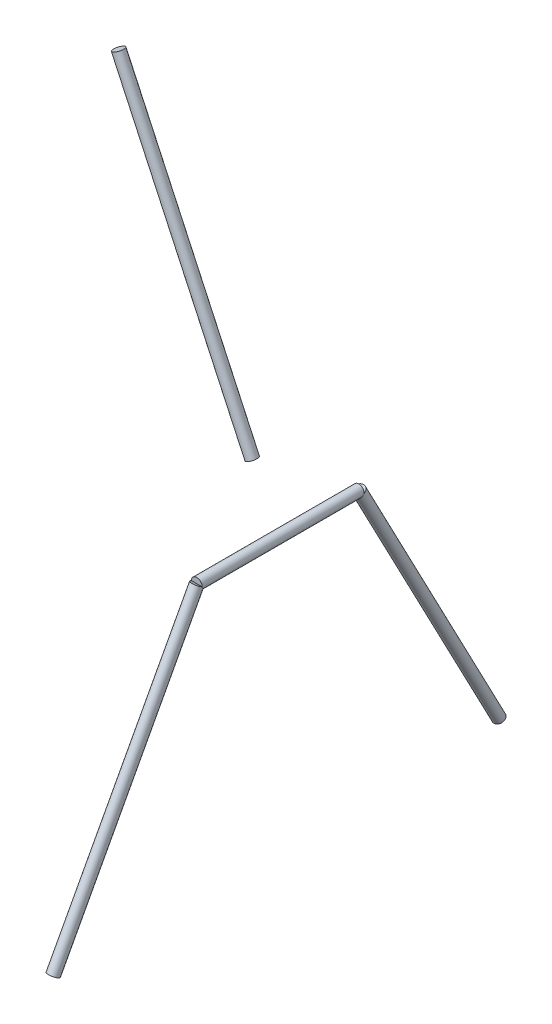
ISO-10303-21;
HEADER;
FILE_DESCRIPTION(('STEP AP214'),'2;1');
FILE_NAME('part.step','',(''),(''),'','','');
FILE_SCHEMA(('AUTOMOTIVE_DESIGN { 1 0 10303 214 1 1 1 1 }'));
ENDSEC;
DATA;
#1=APPLICATION_CONTEXT('core data for automotive mechanical design processes');
#2=APPLICATION_PROTOCOL_DEFINITION('international standard','automotive_design',2000,#1);
#3=PRODUCT_CONTEXT('',#1,'mechanical');
#4=PRODUCT('Part','Part','',(#3));
#5=PRODUCT_RELATED_PRODUCT_CATEGORY('part','',(#4));
#6=PRODUCT_DEFINITION_FORMATION('','',#4);
#7=PRODUCT_DEFINITION_CONTEXT('part definition',#1,'design');
#8=PRODUCT_DEFINITION('design','',#6,#7);
#9=PRODUCT_DEFINITION_SHAPE('','',#8);
#10=(LENGTH_UNIT() NAMED_UNIT(*) SI_UNIT(.MILLI.,.METRE.));
#11=(NAMED_UNIT(*) PLANE_ANGLE_UNIT() SI_UNIT($,.RADIAN.));
#12=(NAMED_UNIT(*) SI_UNIT($,.STERADIAN.) SOLID_ANGLE_UNIT());
#13=UNCERTAINTY_MEASURE_WITH_UNIT(LENGTH_MEASURE(1.E-05),#10,'distance_accuracy_value','');
#14=(GEOMETRIC_REPRESENTATION_CONTEXT(3) GLOBAL_UNCERTAINTY_ASSIGNED_CONTEXT((#13)) GLOBAL_UNIT_ASSIGNED_CONTEXT((#10,
#11,#12)) REPRESENTATION_CONTEXT('',''));
#15=CARTESIAN_POINT('',(0.,0.,0.));
#16=DIRECTION('',(0.,0.,1.));
#17=DIRECTION('',(1.,0.,0.));
#18=AXIS2_PLACEMENT_3D('',#15,#16,#17);
#19=CARTESIAN_POINT('',(421.087581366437,459.553970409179,0.));
#20=DIRECTION('',(-0.420968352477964,0.907075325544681,0.));
#21=DIRECTION('',(-0.907075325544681,-0.420968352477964,0.));
#22=AXIS2_PLACEMENT_3D('',#19,#20,#21);
#23=PLANE('',#22);
#24=CARTESIAN_POINT('',(421.087581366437,459.553970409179,0.));
#25=DIRECTION('',(-0.420968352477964,0.907075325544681,0.));
#26=DIRECTION('',(-0.907075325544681,-0.420968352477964,0.));
#27=AXIS2_PLACEMENT_3D('',#24,#25,#26);
#28=CIRCLE('',#27,0.799999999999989);
#29=CARTESIAN_POINT('',(420.361921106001,459.217195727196,0.));
#30=VERTEX_POINT('',#29);
#31=EDGE_CURVE('E72',#30,#30,#28,.T.);
#32=ORIENTED_EDGE('',*,*,#31,.F.);
#33=EDGE_LOOP('',(#32));
#34=FACE_BOUND('',#33,.T.);
#35=ADVANCED_FACE('F66',(#34),#23,.F.);
#36=CARTESIAN_POINT('',(401.302068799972,502.186510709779,0.));
#37=DIRECTION('',(-0.420968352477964,0.907075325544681,0.));
#38=DIRECTION('',(-0.907075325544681,-0.420968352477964,0.));
#39=AXIS2_PLACEMENT_3D('',#36,#37,#38);
#40=PLANE('',#39);
#41=CARTESIAN_POINT('',(401.302068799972,502.186510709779,0.));
#42=DIRECTION('',(-0.420968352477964,0.907075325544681,0.));
#43=DIRECTION('',(-0.907075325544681,-0.420968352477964,0.));
#44=AXIS2_PLACEMENT_3D('',#41,#42,#43);
#45=CIRCLE('',#44,0.799999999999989);
#46=CARTESIAN_POINT('',(400.576408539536,501.849736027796,0.));
#47=VERTEX_POINT('',#46);
#48=EDGE_CURVE('E12',#47,#47,#45,.T.);
#49=ORIENTED_EDGE('',*,*,#48,.T.);
#50=EDGE_LOOP('',(#49));
#51=FACE_BOUND('',#50,.T.);
#52=ADVANCED_FACE('F81',(#51),#40,.T.);
#53=CARTESIAN_POINT('',(421.087581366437,459.553970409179,0.));
#54=DIRECTION('',(-0.420968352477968,0.907075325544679,0.));
#55=DIRECTION('',(-0.907075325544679,-0.420968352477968,0.));
#56=AXIS2_PLACEMENT_3D('',#53,#54,#55);
#57=CYLINDRICAL_SURFACE('',#56,0.799999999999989);
#58=ORIENTED_EDGE('',*,*,#48,.F.);
#59=EDGE_LOOP('',(#58));
#60=FACE_BOUND('',#59,.T.);
#61=ORIENTED_EDGE('',*,*,#31,.T.);
#62=EDGE_LOOP('',(#61));
#63=FACE_BOUND('',#62,.T.);
#64=ADVANCED_FACE('F78',(#60,#63),#57,.T.);
#65=CLOSED_SHELL('',(#35,#52,#64));
#66=MANIFOLD_SOLID_BREP('B2',#65);
#67=CARTESIAN_POINT('',(424.876296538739,451.390292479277,12.));
#68=DIRECTION('',(0.,0.,1.));
#69=DIRECTION('',(1.,0.,0.));
#70=AXIS2_PLACEMENT_3D('',#67,#68,#69);
#71=PLANE('',#70);
#72=CARTESIAN_POINT('',(424.876296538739,451.390292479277,12.));
#73=DIRECTION('',(0.,0.,1.));
#74=DIRECTION('',(1.,0.,0.));
#75=AXIS2_PLACEMENT_3D('',#72,#73,#74);
#76=CIRCLE('',#75,0.800000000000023);
#77=CARTESIAN_POINT('',(425.676278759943,451.384959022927,12.0000000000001));
#78=VERTEX_POINT('',#77);
#79=CARTESIAN_POINT('',(424.076314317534,451.395625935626,12.));
#80=VERTEX_POINT('',#79);
#81=EDGE_CURVE('E129',#78,#80,#76,.T.);
#82=ORIENTED_EDGE('',*,*,#81,.T.);
#83=DIRECTION('',(0.999977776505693,-0.00666682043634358,0.));
#84=VECTOR('',#83,1.);
#85=CARTESIAN_POINT('',(424.876296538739,451.390292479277,12.));
#86=LINE('',#85,#84);
#87=EDGE_CURVE('E138',#80,#78,#86,.T.);
#88=ORIENTED_EDGE('',*,*,#87,.T.);
#89=EDGE_LOOP('',(#82,#88));
#90=FACE_BOUND('',#89,.T.);
#91=ADVANCED_FACE('F106',(#90),#71,.T.);
#92=CARTESIAN_POINT('',(424.876296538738,451.390292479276,-12.));
#93=DIRECTION('',(0.00589676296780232,0.884474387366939,0.466551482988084));
#94=DIRECTION('',(0.,-0.466559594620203,0.884489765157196));
#95=AXIS2_PLACEMENT_3D('',#92,#93,#94);
#96=PLANE('',#95);
#97=CARTESIAN_POINT('',(424.876296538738,451.390292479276,-12.));
#98=DIRECTION('',(0.00589676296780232,0.884474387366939,0.466551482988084));
#99=DIRECTION('',(0.,-0.466559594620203,0.884489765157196));
#100=AXIS2_PLACEMENT_3D('',#97,#98,#99);
#101=CIRCLE('',#100,0.79999999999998);
#102=CARTESIAN_POINT('',(425.676278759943,451.384959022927,-12.));
#103=VERTEX_POINT('',#102);
#104=CARTESIAN_POINT('',(424.076314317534,451.395625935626,-12.0000000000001));
#105=VERTEX_POINT('',#104);
#106=EDGE_CURVE('E159',#103,#105,#101,.T.);
#107=ORIENTED_EDGE('',*,*,#106,.T.);
#108=DIRECTION('',(0.999977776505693,-0.00666682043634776,0.));
#109=VECTOR('',#108,1.);
#110=CARTESIAN_POINT('',(424.876296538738,451.390292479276,-12.));
#111=LINE('',#110,#109);
#112=EDGE_CURVE('E135',#105,#103,#111,.T.);
#113=ORIENTED_EDGE('',*,*,#112,.T.);
#114=EDGE_LOOP('',(#107,#113));
#115=FACE_BOUND('',#114,.T.);
#116=ADVANCED_FACE('F165',(#115),#96,.T.);
#117=CARTESIAN_POINT('',(424.610876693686,411.579118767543,-33.0000000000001));
#118=DIRECTION('',(0.00589676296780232,0.884474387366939,0.466551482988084));
#119=DIRECTION('',(0.,-0.466559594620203,0.884489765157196));
#120=AXIS2_PLACEMENT_3D('',#117,#118,#119);
#121=PLANE('',#120);
#122=CARTESIAN_POINT('',(424.610876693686,411.579118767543,-33.0000000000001));
#123=DIRECTION('',(0.00589676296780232,0.884474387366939,0.466551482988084));
#124=DIRECTION('',(0.,-0.466559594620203,0.884489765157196));
#125=AXIS2_PLACEMENT_3D('',#122,#123,#124);
#126=CIRCLE('',#125,0.79999999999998);
#127=CARTESIAN_POINT('',(424.610876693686,411.205871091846,-32.2924081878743));
#128=VERTEX_POINT('',#127);
#129=EDGE_CURVE('E156',#128,#128,#126,.T.);
#130=ORIENTED_EDGE('',*,*,#129,.F.);
#131=EDGE_LOOP('',(#130));
#132=FACE_BOUND('',#131,.T.);
#133=ADVANCED_FACE('F108',(#132),#121,.F.);
#134=CARTESIAN_POINT('',(424.610876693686,411.579118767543,-33.0000000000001));
#135=DIRECTION('',(0.00589676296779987,0.884474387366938,0.466551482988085));
#136=DIRECTION('',(0.,-0.466559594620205,0.884489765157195));
#137=AXIS2_PLACEMENT_3D('',#134,#135,#136);
#138=CYLINDRICAL_SURFACE('',#137,0.79999999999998);
#139=CARTESIAN_POINT('',(424.876296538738,451.390292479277,-12.));
#140=DIRECTION('',(0.00344310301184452,0.516442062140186,0.856315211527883));
#141=DIRECTION('',(0.00570889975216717,0.856296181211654,-0.516453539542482));
#142=AXIS2_PLACEMENT_3D('',#139,#140,#141);
#143=ELLIPSE('',#142,0.934235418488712,0.800000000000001);
#144=EDGE_CURVE('E114',#105,#103,#143,.T.);
#145=ORIENTED_EDGE('',*,*,#144,.F.);
#146=ORIENTED_EDGE('',*,*,#106,.F.);
#147=EDGE_LOOP('',(#145,#146));
#148=FACE_BOUND('',#147,.T.);
#149=ORIENTED_EDGE('',*,*,#129,.T.);
#150=EDGE_LOOP('',(#149));
#151=FACE_BOUND('',#150,.T.);
#152=ADVANCED_FACE('F166',(#148,#151),#138,.T.);
#153=CARTESIAN_POINT('',(424.876296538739,451.390292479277,-12.));
#154=DIRECTION('',(0.,0.,1.));
#155=DIRECTION('',(1.,0.,0.));
#156=AXIS2_PLACEMENT_3D('',#153,#154,#155);
#157=PLANE('',#156);
#158=ORIENTED_EDGE('',*,*,#112,.F.);
#159=CARTESIAN_POINT('',(424.876296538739,451.390292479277,-12.));
#160=DIRECTION('',(0.,0.,1.));
#161=DIRECTION('',(1.,0.,0.));
#162=AXIS2_PLACEMENT_3D('',#159,#160,#161);
#163=CIRCLE('',#162,0.800000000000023);
#164=EDGE_CURVE('E136',#103,#105,#163,.T.);
#165=ORIENTED_EDGE('',*,*,#164,.F.);
#166=EDGE_LOOP('',(#158,#165));
#167=FACE_BOUND('',#166,.T.);
#168=ADVANCED_FACE('F163',(#167),#157,.F.);
#169=CARTESIAN_POINT('',(424.876296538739,451.390292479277,-12.));
#170=DIRECTION('',(0.,0.,1.));
#171=DIRECTION('',(1.,0.,0.));
#172=AXIS2_PLACEMENT_3D('',#169,#170,#171);
#173=CYLINDRICAL_SURFACE('',#172,0.800000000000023);
#174=CARTESIAN_POINT('',(424.876296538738,451.390292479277,12.));
#175=DIRECTION('',(-0.00344310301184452,-0.516442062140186,0.856315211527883));
#176=DIRECTION('',(0.00570889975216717,0.856296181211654,0.516453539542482));
#177=AXIS2_PLACEMENT_3D('',#174,#175,#176);
#178=ELLIPSE('',#177,0.934235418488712,0.800000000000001);
#179=EDGE_CURVE('E64',#80,#78,#178,.T.);
#180=ORIENTED_EDGE('',*,*,#179,.F.);
#181=ORIENTED_EDGE('',*,*,#81,.F.);
#182=EDGE_LOOP('',(#180,#181));
#183=FACE_BOUND('',#182,.T.);
#184=ORIENTED_EDGE('',*,*,#164,.T.);
#185=ORIENTED_EDGE('',*,*,#144,.T.);
#186=EDGE_LOOP('',(#184,#185));
#187=FACE_BOUND('',#186,.T.);
#188=ADVANCED_FACE('F131',(#183,#187),#173,.T.);
#189=CARTESIAN_POINT('',(424.876296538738,451.390292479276,12.));
#190=DIRECTION('',(-0.00589676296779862,-0.884474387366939,0.466551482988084));
#191=DIRECTION('',(0.,-0.466559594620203,-0.884489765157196));
#192=AXIS2_PLACEMENT_3D('',#189,#190,#191);
#193=PLANE('',#192);
#194=ORIENTED_EDGE('',*,*,#87,.F.);
#195=CARTESIAN_POINT('',(424.876296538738,451.390292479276,12.));
#196=DIRECTION('',(-0.00589676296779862,-0.884474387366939,0.466551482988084));
#197=DIRECTION('',(0.,-0.466559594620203,-0.884489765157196));
#198=AXIS2_PLACEMENT_3D('',#195,#196,#197);
#199=CIRCLE('',#198,0.79999999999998);
#200=EDGE_CURVE('E146',#78,#80,#199,.T.);
#201=ORIENTED_EDGE('',*,*,#200,.F.);
#202=EDGE_LOOP('',(#194,#201));
#203=FACE_BOUND('',#202,.T.);
#204=ADVANCED_FACE('F147',(#203),#193,.F.);
#205=CARTESIAN_POINT('',(424.610876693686,411.579118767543,33.0000000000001));
#206=DIRECTION('',(-0.00589676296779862,-0.884474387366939,0.466551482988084));
#207=DIRECTION('',(0.,-0.466559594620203,-0.884489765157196));
#208=AXIS2_PLACEMENT_3D('',#205,#206,#207);
#209=PLANE('',#208);
#210=CARTESIAN_POINT('',(424.610876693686,411.579118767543,33.0000000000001));
#211=DIRECTION('',(-0.00589676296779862,-0.884474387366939,0.466551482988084));
#212=DIRECTION('',(0.,-0.466559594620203,-0.884489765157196));
#213=AXIS2_PLACEMENT_3D('',#210,#211,#212);
#214=CIRCLE('',#213,0.79999999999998);
#215=CARTESIAN_POINT('',(424.610876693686,411.205871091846,32.2924081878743));
#216=VERTEX_POINT('',#215);
#217=EDGE_CURVE('E142',#216,#216,#214,.T.);
#218=ORIENTED_EDGE('',*,*,#217,.T.);
#219=EDGE_LOOP('',(#218));
#220=FACE_BOUND('',#219,.T.);
#221=ADVANCED_FACE('F188',(#220),#209,.T.);
#222=CARTESIAN_POINT('',(424.876296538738,451.390292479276,12.));
#223=DIRECTION('',(-0.00589676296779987,-0.884474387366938,0.466551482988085));
#224=DIRECTION('',(0.,-0.466559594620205,-0.884489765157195));
#225=AXIS2_PLACEMENT_3D('',#222,#223,#224);
#226=CYLINDRICAL_SURFACE('',#225,0.79999999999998);
#227=ORIENTED_EDGE('',*,*,#217,.F.);
#228=EDGE_LOOP('',(#227));
#229=FACE_BOUND('',#228,.T.);
#230=ORIENTED_EDGE('',*,*,#200,.T.);
#231=ORIENTED_EDGE('',*,*,#179,.T.);
#232=EDGE_LOOP('',(#230,#231));
#233=FACE_BOUND('',#232,.T.);
#234=ADVANCED_FACE('F145',(#229,#233),#226,.T.);
#235=CLOSED_SHELL('',(#91,#116,#133,#152,#168,#188,#204,#221,#234));
#236=MANIFOLD_SOLID_BREP('B7',#235);
#237=ADVANCED_BREP_SHAPE_REPRESENTATION('',(#18,#66,#236),#14);
#238=SHAPE_DEFINITION_REPRESENTATION(#9,#237);
ENDSEC;
END-ISO-10303-21;
